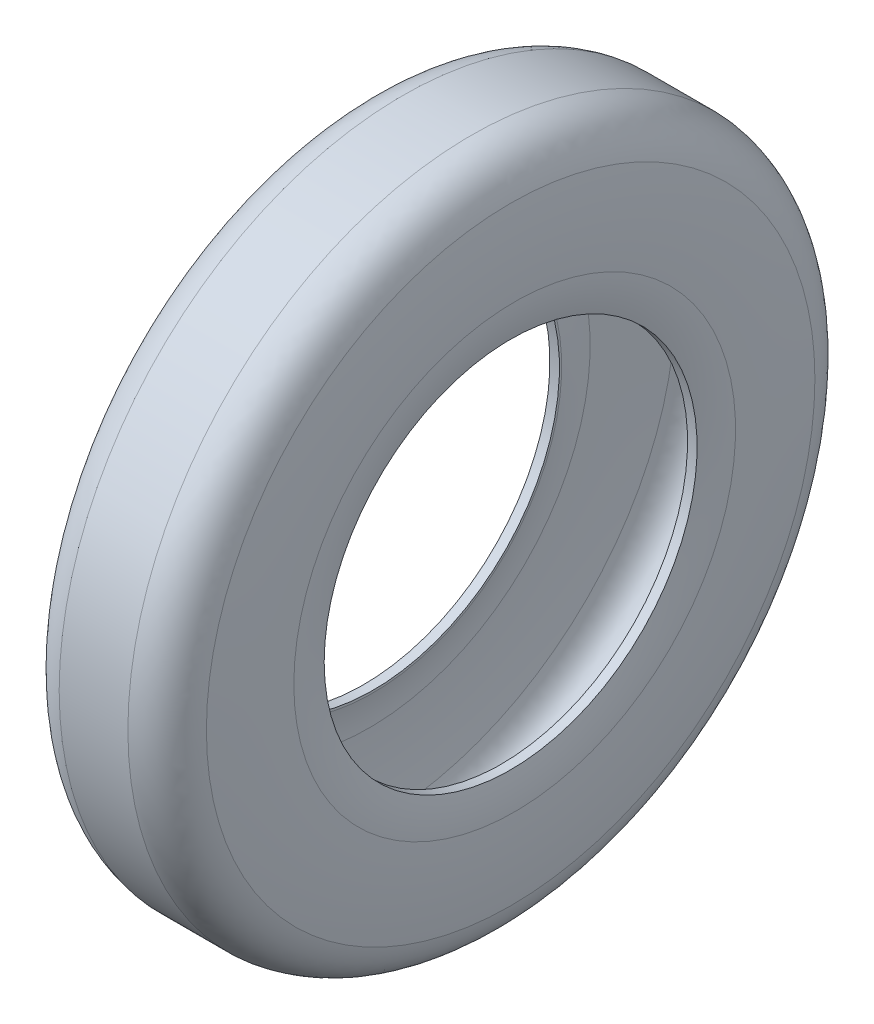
from build123d import *


with BuildPart() as part:
    # izim2 → D_nd_r2 (revolve)
    with BuildSketch(Plane.XY, mode=Mode.PRIVATE) as d_nd_r2_sk:
        with BuildLine():
            Line((-17.5, 175), (17.5, 175))
            add(Edge.make_bspline(
                [(37.5, 155), (33.180831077, 172.735676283), (17.5, 175)],
                knots=[0, 0, 0, 1, 1, 1], degree=2))
            add(Edge.make_bspline(
                [(39.558004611, 112.515379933), (40.037526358, 133.823558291), (37.5, 155)],
                knots=[0, 0, 0, 1, 1, 1], degree=2))
            add(Edge.make_bspline(
                [(37.5, 95), (39.553838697, 103.632489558), (39.558004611, 112.515379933)],
                knots=[0, 0, 0, 1, 1, 1], degree=2))
            Line((37.5, 95), (32.635776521, 95))
            Line((32.635776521, 95), (32.635776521, 96.157294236))
            add(Edge.make_bspline(
                [(34.558030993, 112.572805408), (34.560206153, 104.242772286), (32.635776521, 96.157294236)],
                knots=[0, 0, 0, 1.003100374, 1.003100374, 1.003100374], degree=2))
            add(Edge.make_bspline(
                [(32.571883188, 154.100277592), (35.030598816, 133.401140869), (34.558030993, 112.572805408)],
                knots=[-0.001292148, -0.001292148, -0.001292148, 0.992681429, 0.992681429, 0.992681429], degree=2))
            add(Edge.make_bspline(
                [(17.124055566, 170), (19.474259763, 169.620198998), (23.300690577, 168.10451916), (26.942501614, 165.499652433), (29.8373746, 161.506356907), (31.847105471, 156.962883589), (32.571883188, 154.100277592)],
                knots=[0.00902413, 0.00902413, 0.00902413, 0.192379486, 0.375734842, 0.620208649, 0.803564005, 0.986919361, 0.986919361, 0.986919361], degree=2))
            Line((17.124055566, 170), (-17.124055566, 170))
            add(Edge.make_bspline(
                [(-32.571883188, 154.100277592), (-31.847105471, 156.962883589), (-29.8373746, 161.506356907), (-26.942501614, 165.499652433), (-23.300690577, 168.10451916), (-19.474259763, 169.620198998), (-17.124055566, 170)],
                knots=[0.00902413, 0.00902413, 0.00902413, 0.192379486, 0.375734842, 0.620208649, 0.803564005, 0.986919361, 0.986919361, 0.986919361], degree=2))
            add(Edge.make_bspline(
                [(-34.558030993, 112.572805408), (-35.030598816, 133.401140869), (-32.571883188, 154.100277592)],
                knots=[-0.001292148, -0.001292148, -0.001292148, 0.992681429, 0.992681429, 0.992681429], degree=2))
            add(Edge.make_bspline(
                [(-32.635776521, 96.157294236), (-34.560206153, 104.242772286), (-34.558030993, 112.572805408)],
                knots=[0, 0, 0, 1.003100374, 1.003100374, 1.003100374], degree=2))
            Line((-32.635776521, 96.157294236), (-32.635776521, 95))
            Line((-32.635776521, 95), (-37.5, 95))
            add(Edge.make_bspline(
                [(-37.5, 95), (-39.553838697, 103.632489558), (-39.558004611, 112.515379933)],
                knots=[0, 0, 0, 1, 1, 1], degree=2))
            add(Edge.make_bspline(
                [(-39.558004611, 112.515379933), (-40.037526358, 133.823558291), (-37.5, 155)],
                knots=[0, 0, 0, 1, 1, 1], degree=2))
            add(Edge.make_bspline(
                [(-37.5, 155), (-33.180831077, 172.735676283), (-17.5, 175)],
                knots=[0, 0, 0, 1, 1, 1], degree=2))
        make_face()
    revolve(d_nd_r2_sk.sketch.rotate(Axis((-171.693896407, 0, 0), (1, 0, 0)), 90), axis=Axis((-171.693896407, 0, 0), (1, 0, 0)))


solid = part.part
